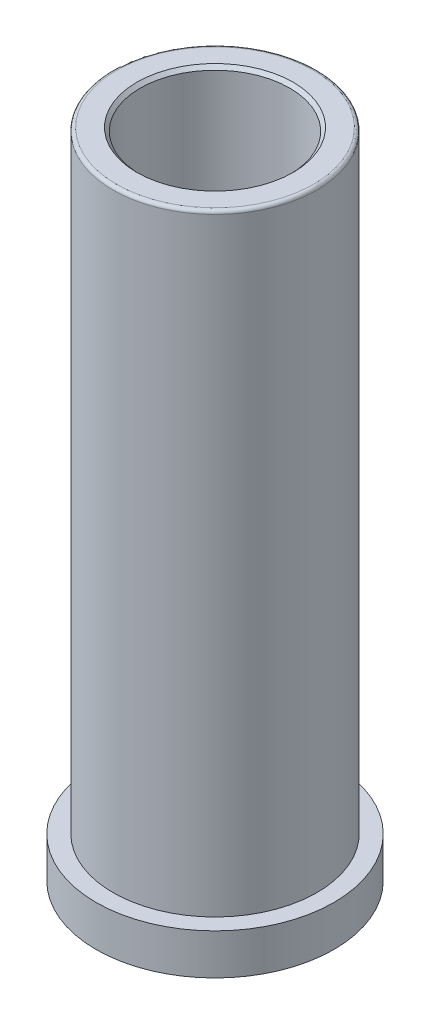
ISO-10303-21;
HEADER;
FILE_DESCRIPTION(('STEP AP214'),'2;1');
FILE_NAME('part.step','',(''),(''),'','','');
FILE_SCHEMA(('AUTOMOTIVE_DESIGN { 1 0 10303 214 1 1 1 1 }'));
ENDSEC;
DATA;
#1=APPLICATION_CONTEXT('core data for automotive mechanical design processes');
#2=APPLICATION_PROTOCOL_DEFINITION('international standard','automotive_design',2000,#1);
#3=PRODUCT_CONTEXT('',#1,'mechanical');
#4=PRODUCT('Part','Part','',(#3));
#5=PRODUCT_RELATED_PRODUCT_CATEGORY('part','',(#4));
#6=PRODUCT_DEFINITION_FORMATION('','',#4);
#7=PRODUCT_DEFINITION_CONTEXT('part definition',#1,'design');
#8=PRODUCT_DEFINITION('design','',#6,#7);
#9=PRODUCT_DEFINITION_SHAPE('','',#8);
#10=(LENGTH_UNIT() NAMED_UNIT(*) SI_UNIT(.MILLI.,.METRE.));
#11=(NAMED_UNIT(*) PLANE_ANGLE_UNIT() SI_UNIT($,.RADIAN.));
#12=(NAMED_UNIT(*) SI_UNIT($,.STERADIAN.) SOLID_ANGLE_UNIT());
#13=UNCERTAINTY_MEASURE_WITH_UNIT(LENGTH_MEASURE(1.E-05),#10,'distance_accuracy_value','');
#14=(GEOMETRIC_REPRESENTATION_CONTEXT(3) GLOBAL_UNCERTAINTY_ASSIGNED_CONTEXT((#13)) GLOBAL_UNIT_ASSIGNED_CONTEXT((#10,
#11,#12)) REPRESENTATION_CONTEXT('',''));
#15=CARTESIAN_POINT('',(0.,0.,0.));
#16=DIRECTION('',(0.,0.,1.));
#17=DIRECTION('',(1.,0.,0.));
#18=AXIS2_PLACEMENT_3D('',#15,#16,#17);
#19=CARTESIAN_POINT('',(0.,0.,0.));
#20=DIRECTION('',(0.,-1.,0.));
#21=DIRECTION('',(0.,0.,-1.));
#22=AXIS2_PLACEMENT_3D('',#19,#20,#21);
#23=CYLINDRICAL_SURFACE('',#22,15.);
#24=CARTESIAN_POINT('',(0.,89.5,0.));
#25=DIRECTION('',(0.,-1.,0.));
#26=DIRECTION('',(0.,0.,-1.));
#27=AXIS2_PLACEMENT_3D('',#24,#25,#26);
#28=CIRCLE('',#27,15.);
#29=CARTESIAN_POINT('',(0.,89.5,-15.));
#30=VERTEX_POINT('',#29);
#31=EDGE_CURVE('E21',#30,#30,#28,.T.);
#32=ORIENTED_EDGE('',*,*,#31,.T.);
#33=EDGE_LOOP('',(#32));
#34=FACE_BOUND('',#33,.T.);
#35=CARTESIAN_POINT('',(0.,0.,0.));
#36=DIRECTION('',(0.,-1.,0.));
#37=DIRECTION('',(0.,0.,-1.));
#38=AXIS2_PLACEMENT_3D('',#35,#36,#37);
#39=CIRCLE('',#38,15.);
#40=CARTESIAN_POINT('',(0.,0.,-15.));
#41=VERTEX_POINT('',#40);
#42=EDGE_CURVE('E58',#41,#41,#39,.T.);
#43=ORIENTED_EDGE('',*,*,#42,.F.);
#44=EDGE_LOOP('',(#43));
#45=FACE_BOUND('',#44,.T.);
#46=ADVANCED_FACE('F13',(#34,#45),#23,.T.);
#47=CARTESIAN_POINT('',(-15.,90.,0.));
#48=DIRECTION('',(0.,-1.,0.));
#49=DIRECTION('',(0.,0.,-1.));
#50=AXIS2_PLACEMENT_3D('',#47,#48,#49);
#51=PLANE('',#50);
#52=CARTESIAN_POINT('',(0.,90.,0.));
#53=DIRECTION('',(0.,-1.,0.));
#54=DIRECTION('',(0.,0.,-1.));
#55=AXIS2_PLACEMENT_3D('',#52,#53,#54);
#56=CIRCLE('',#55,14.5);
#57=CARTESIAN_POINT('',(0.,90.,-14.5));
#58=VERTEX_POINT('',#57);
#59=EDGE_CURVE('E8',#58,#58,#56,.F.);
#60=ORIENTED_EDGE('',*,*,#59,.T.);
#61=EDGE_LOOP('',(#60));
#62=FACE_BOUND('',#61,.T.);
#63=CARTESIAN_POINT('',(0.,90.,0.));
#64=DIRECTION('',(0.,-1.,0.));
#65=DIRECTION('',(0.,0.,-1.));
#66=AXIS2_PLACEMENT_3D('',#63,#64,#65);
#67=CIRCLE('',#66,11.5);
#68=CARTESIAN_POINT('',(0.,90.,-11.5));
#69=VERTEX_POINT('',#68);
#70=EDGE_CURVE('E45',#69,#69,#67,.T.);
#71=ORIENTED_EDGE('',*,*,#70,.T.);
#72=EDGE_LOOP('',(#71));
#73=FACE_BOUND('',#72,.T.);
#74=ADVANCED_FACE('F66',(#62,#73),#51,.F.);
#75=CARTESIAN_POINT('',(0.,0.,0.));
#76=DIRECTION('',(0.,-1.,0.));
#77=DIRECTION('',(0.,0.,-1.));
#78=AXIS2_PLACEMENT_3D('',#75,#76,#77);
#79=CYLINDRICAL_SURFACE('',#78,11.);
#80=CARTESIAN_POINT('',(0.,89.5,0.));
#81=DIRECTION('',(0.,-1.,0.));
#82=DIRECTION('',(0.,0.,-1.));
#83=AXIS2_PLACEMENT_3D('',#80,#81,#82);
#84=CIRCLE('',#83,11.);
#85=CARTESIAN_POINT('',(0.,89.5,-11.));
#86=VERTEX_POINT('',#85);
#87=EDGE_CURVE('E41',#86,#86,#84,.F.);
#88=ORIENTED_EDGE('',*,*,#87,.T.);
#89=EDGE_LOOP('',(#88));
#90=FACE_BOUND('',#89,.T.);
#91=CARTESIAN_POINT('',(0.,-6.,0.));
#92=DIRECTION('',(0.,-1.,0.));
#93=DIRECTION('',(0.,0.,-1.));
#94=AXIS2_PLACEMENT_3D('',#91,#92,#93);
#95=CIRCLE('',#94,11.);
#96=CARTESIAN_POINT('',(0.,-6.,-11.));
#97=VERTEX_POINT('',#96);
#98=EDGE_CURVE('E48',#97,#97,#95,.T.);
#99=ORIENTED_EDGE('',*,*,#98,.T.);
#100=EDGE_LOOP('',(#99));
#101=FACE_BOUND('',#100,.T.);
#102=ADVANCED_FACE('F71',(#90,#101),#79,.F.);
#103=CARTESIAN_POINT('',(0.,-6.15,0.));
#104=DIRECTION('',(0.,-1.,0.));
#105=DIRECTION('',(0.,0.,-1.));
#106=AXIS2_PLACEMENT_3D('',#103,#104,#105);
#107=CONICAL_SURFACE('',#106,11.1,0.588002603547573);
#108=CARTESIAN_POINT('',(0.,-6.36,0.));
#109=DIRECTION('',(0.,1.,0.));
#110=DIRECTION('',(0.,0.,1.));
#111=AXIS2_PLACEMENT_3D('',#108,#109,#110);
#112=CIRCLE('',#111,11.24);
#113=CARTESIAN_POINT('',(0.,-6.36,11.24));
#114=VERTEX_POINT('',#113);
#115=EDGE_CURVE('E29',#114,#114,#112,.F.);
#116=ORIENTED_EDGE('',*,*,#115,.T.);
#117=EDGE_LOOP('',(#116));
#118=FACE_BOUND('',#117,.T.);
#119=ORIENTED_EDGE('',*,*,#98,.F.);
#120=EDGE_LOOP('',(#119));
#121=FACE_BOUND('',#120,.T.);
#122=ADVANCED_FACE('F88',(#118,#121),#107,.F.);
#123=CARTESIAN_POINT('',(-11.1,-6.,0.));
#124=DIRECTION('',(0.,1.,0.));
#125=DIRECTION('',(0.,0.,1.));
#126=AXIS2_PLACEMENT_3D('',#123,#124,#125);
#127=PLANE('',#126);
#128=CARTESIAN_POINT('',(0.,-6.,0.));
#129=DIRECTION('',(0.,1.,0.));
#130=DIRECTION('',(0.,0.,1.));
#131=AXIS2_PLACEMENT_3D('',#128,#129,#130);
#132=CIRCLE('',#131,11.6);
#133=CARTESIAN_POINT('',(0.,-6.,11.6));
#134=VERTEX_POINT('',#133);
#135=EDGE_CURVE('E35',#134,#134,#132,.T.);
#136=ORIENTED_EDGE('',*,*,#135,.T.);
#137=EDGE_LOOP('',(#136));
#138=FACE_BOUND('',#137,.T.);
#139=CARTESIAN_POINT('',(0.,-6.,0.));
#140=DIRECTION('',(0.,-1.,0.));
#141=DIRECTION('',(0.,0.,-1.));
#142=AXIS2_PLACEMENT_3D('',#139,#140,#141);
#143=CIRCLE('',#142,17.5);
#144=CARTESIAN_POINT('',(0.,-6.,-17.5));
#145=VERTEX_POINT('',#144);
#146=EDGE_CURVE('E51',#145,#145,#143,.T.);
#147=ORIENTED_EDGE('',*,*,#146,.T.);
#148=EDGE_LOOP('',(#147));
#149=FACE_BOUND('',#148,.T.);
#150=ADVANCED_FACE('F91',(#138,#149),#127,.F.);
#151=CARTESIAN_POINT('',(0.,0.,0.));
#152=DIRECTION('',(0.,-1.,0.));
#153=DIRECTION('',(0.,0.,-1.));
#154=AXIS2_PLACEMENT_3D('',#151,#152,#153);
#155=CYLINDRICAL_SURFACE('',#154,17.5);
#156=ORIENTED_EDGE('',*,*,#146,.F.);
#157=EDGE_LOOP('',(#156));
#158=FACE_BOUND('',#157,.T.);
#159=CARTESIAN_POINT('',(0.,0.,0.));
#160=DIRECTION('',(0.,-1.,0.));
#161=DIRECTION('',(0.,0.,-1.));
#162=AXIS2_PLACEMENT_3D('',#159,#160,#161);
#163=CIRCLE('',#162,17.5);
#164=CARTESIAN_POINT('',(0.,0.,-17.5));
#165=VERTEX_POINT('',#164);
#166=EDGE_CURVE('E55',#165,#165,#163,.T.);
#167=ORIENTED_EDGE('',*,*,#166,.T.);
#168=EDGE_LOOP('',(#167));
#169=FACE_BOUND('',#168,.T.);
#170=ADVANCED_FACE('F101',(#158,#169),#155,.T.);
#171=CARTESIAN_POINT('',(-17.5,0.,0.));
#172=DIRECTION('',(0.,-1.,0.));
#173=DIRECTION('',(0.,0.,-1.));
#174=AXIS2_PLACEMENT_3D('',#171,#172,#173);
#175=PLANE('',#174);
#176=ORIENTED_EDGE('',*,*,#166,.F.);
#177=EDGE_LOOP('',(#176));
#178=FACE_BOUND('',#177,.T.);
#179=ORIENTED_EDGE('',*,*,#42,.T.);
#180=EDGE_LOOP('',(#179));
#181=FACE_BOUND('',#180,.T.);
#182=ADVANCED_FACE('F63',(#178,#181),#175,.F.);
#183=CARTESIAN_POINT('',(0.,90.,0.));
#184=DIRECTION('',(0.,1.,0.));
#185=DIRECTION('',(0.,0.,1.));
#186=AXIS2_PLACEMENT_3D('',#183,#184,#185);
#187=CONICAL_SURFACE('',#186,11.5,0.785398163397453);
#188=ORIENTED_EDGE('',*,*,#87,.F.);
#189=EDGE_LOOP('',(#188));
#190=FACE_BOUND('',#189,.T.);
#191=ORIENTED_EDGE('',*,*,#70,.F.);
#192=EDGE_LOOP('',(#191));
#193=FACE_BOUND('',#192,.T.);
#194=ADVANCED_FACE('F75',(#190,#193),#187,.F.);
#195=CARTESIAN_POINT('',(0.,-6.5,0.));
#196=DIRECTION('',(0.,1.,0.));
#197=DIRECTION('',(0.,0.,1.));
#198=AXIS2_PLACEMENT_3D('',#195,#196,#197);
#199=CONICAL_SURFACE('',#198,11.1,0.785398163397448);
#200=ORIENTED_EDGE('',*,*,#135,.F.);
#201=EDGE_LOOP('',(#200));
#202=FACE_BOUND('',#201,.T.);
#203=ORIENTED_EDGE('',*,*,#115,.F.);
#204=EDGE_LOOP('',(#203));
#205=FACE_BOUND('',#204,.T.);
#206=ADVANCED_FACE('F77',(#202,#205),#199,.T.);
#207=CARTESIAN_POINT('',(0.,89.5,0.));
#208=DIRECTION('',(0.,-1.,0.));
#209=DIRECTION('',(0.,0.,-1.));
#210=AXIS2_PLACEMENT_3D('',#207,#208,#209);
#211=TOROIDAL_SURFACE('',#210,14.5,0.5);
#212=ORIENTED_EDGE('',*,*,#59,.F.);
#213=EDGE_LOOP('',(#212));
#214=FACE_BOUND('',#213,.T.);
#215=ORIENTED_EDGE('',*,*,#31,.F.);
#216=EDGE_LOOP('',(#215));
#217=FACE_BOUND('',#216,.T.);
#218=ADVANCED_FACE('F15',(#214,#217),#211,.T.);
#219=CLOSED_SHELL('',(#46,#74,#102,#122,#150,#170,#182,#194,#206,#218));
#220=MANIFOLD_SOLID_BREP('B1',#219);
#221=ADVANCED_BREP_SHAPE_REPRESENTATION('',(#18,#220),#14);
#222=SHAPE_DEFINITION_REPRESENTATION(#9,#221);
ENDSEC;
END-ISO-10303-21;
